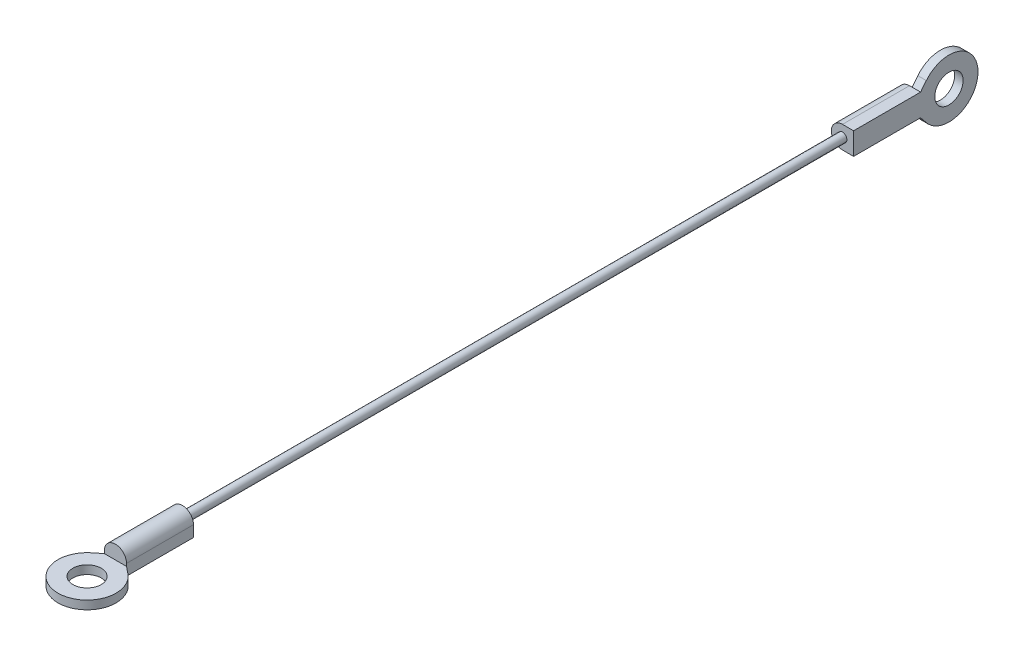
ISO-10303-21;
HEADER;
FILE_DESCRIPTION(('STEP AP214'),'2;1');
FILE_NAME('part.step','',(''),(''),'','','');
FILE_SCHEMA(('AUTOMOTIVE_DESIGN { 1 0 10303 214 1 1 1 1 }'));
ENDSEC;
DATA;
#1=APPLICATION_CONTEXT('core data for automotive mechanical design processes');
#2=APPLICATION_PROTOCOL_DEFINITION('international standard','automotive_design',2000,#1);
#3=PRODUCT_CONTEXT('',#1,'mechanical');
#4=PRODUCT('Part','Part','',(#3));
#5=PRODUCT_RELATED_PRODUCT_CATEGORY('part','',(#4));
#6=PRODUCT_DEFINITION_FORMATION('','',#4);
#7=PRODUCT_DEFINITION_CONTEXT('part definition',#1,'design');
#8=PRODUCT_DEFINITION('design','',#6,#7);
#9=PRODUCT_DEFINITION_SHAPE('','',#8);
#10=(LENGTH_UNIT() NAMED_UNIT(*) SI_UNIT(.MILLI.,.METRE.));
#11=(NAMED_UNIT(*) PLANE_ANGLE_UNIT() SI_UNIT($,.RADIAN.));
#12=(NAMED_UNIT(*) SI_UNIT($,.STERADIAN.) SOLID_ANGLE_UNIT());
#13=UNCERTAINTY_MEASURE_WITH_UNIT(LENGTH_MEASURE(1.E-05),#10,'distance_accuracy_value','');
#14=(GEOMETRIC_REPRESENTATION_CONTEXT(3) GLOBAL_UNCERTAINTY_ASSIGNED_CONTEXT((#13)) GLOBAL_UNIT_ASSIGNED_CONTEXT((#10,
#11,#12)) REPRESENTATION_CONTEXT('',''));
#15=CARTESIAN_POINT('',(0.,0.,0.));
#16=DIRECTION('',(0.,0.,1.));
#17=DIRECTION('',(1.,0.,0.));
#18=AXIS2_PLACEMENT_3D('',#15,#16,#17);
#19=CARTESIAN_POINT('',(0.,0.,-71.12));
#20=DIRECTION('',(0.,0.,-1.));
#21=DIRECTION('',(-1.,0.,0.));
#22=AXIS2_PLACEMENT_3D('',#19,#20,#21);
#23=PLANE('',#22);
#24=DIRECTION('',(1.,0.,0.));
#25=VECTOR('',#24,1.);
#26=CARTESIAN_POINT('',(0.,1.99,-71.12));
#27=LINE('',#26,#25);
#28=CARTESIAN_POINT('',(0.,1.99,-71.12));
#29=VERTEX_POINT('',#28);
#30=CARTESIAN_POINT('',(0.47,1.99,-71.12));
#31=VERTEX_POINT('',#30);
#32=EDGE_CURVE('E197',#29,#31,#27,.T.);
#33=ORIENTED_EDGE('',*,*,#32,.T.);
#34=DIRECTION('',(0.,-1.,0.));
#35=VECTOR('',#34,1.);
#36=CARTESIAN_POINT('',(0.47,-1.99,-71.12));
#37=LINE('',#36,#35);
#38=CARTESIAN_POINT('',(0.47,-1.99,-71.12));
#39=VERTEX_POINT('',#38);
#40=EDGE_CURVE('E154',#31,#39,#37,.T.);
#41=ORIENTED_EDGE('',*,*,#40,.T.);
#42=DIRECTION('',(-1.,0.,0.));
#43=VECTOR('',#42,1.);
#44=CARTESIAN_POINT('',(1.99,-1.99,-71.12));
#45=LINE('',#44,#43);
#46=CARTESIAN_POINT('',(0.,-1.99,-71.12));
#47=VERTEX_POINT('',#46);
#48=EDGE_CURVE('E202',#39,#47,#45,.T.);
#49=ORIENTED_EDGE('',*,*,#48,.T.);
#50=CARTESIAN_POINT('',(0.,0.,-71.12));
#51=DIRECTION('',(0.,0.,-1.));
#52=DIRECTION('',(-1.,0.,0.));
#53=AXIS2_PLACEMENT_3D('',#50,#51,#52);
#54=CIRCLE('',#53,1.99);
#55=EDGE_CURVE('E193',#47,#29,#54,.T.);
#56=ORIENTED_EDGE('',*,*,#55,.T.);
#57=EDGE_LOOP('',(#33,#41,#49,#56));
#58=FACE_BOUND('',#57,.T.);
#59=ADVANCED_FACE('F39',(#58),#23,.T.);
#60=CARTESIAN_POINT('',(0.,0.,71.12));
#61=DIRECTION('',(0.,0.,1.));
#62=DIRECTION('',(1.,0.,0.));
#63=AXIS2_PLACEMENT_3D('',#60,#61,#62);
#64=PLANE('',#63);
#65=DIRECTION('',(0.,-1.,0.));
#66=VECTOR('',#65,1.);
#67=CARTESIAN_POINT('',(-1.99,0.,71.12));
#68=LINE('',#67,#66);
#69=CARTESIAN_POINT('',(-1.99,0.,71.12));
#70=VERTEX_POINT('',#69);
#71=CARTESIAN_POINT('',(-1.99,-0.47,71.12));
#72=VERTEX_POINT('',#71);
#73=EDGE_CURVE('E280',#70,#72,#68,.T.);
#74=ORIENTED_EDGE('',*,*,#73,.T.);
#75=DIRECTION('',(1.,0.,0.));
#76=VECTOR('',#75,1.);
#77=CARTESIAN_POINT('',(-1.99,-0.47,71.12));
#78=LINE('',#77,#76);
#79=CARTESIAN_POINT('',(1.99,-0.47,71.12));
#80=VERTEX_POINT('',#79);
#81=EDGE_CURVE('E241',#72,#80,#78,.T.);
#82=ORIENTED_EDGE('',*,*,#81,.T.);
#83=DIRECTION('',(0.,1.,0.));
#84=VECTOR('',#83,1.);
#85=CARTESIAN_POINT('',(1.99,-1.99,71.12));
#86=LINE('',#85,#84);
#87=CARTESIAN_POINT('',(1.99,0.,71.12));
#88=VERTEX_POINT('',#87);
#89=EDGE_CURVE('E285',#80,#88,#86,.T.);
#90=ORIENTED_EDGE('',*,*,#89,.T.);
#91=CARTESIAN_POINT('',(0.,0.,71.12));
#92=DIRECTION('',(0.,0.,1.));
#93=DIRECTION('',(1.,0.,0.));
#94=AXIS2_PLACEMENT_3D('',#91,#92,#93);
#95=CIRCLE('',#94,1.99);
#96=EDGE_CURVE('E276',#88,#70,#95,.T.);
#97=ORIENTED_EDGE('',*,*,#96,.T.);
#98=EDGE_LOOP('',(#74,#82,#90,#97));
#99=FACE_BOUND('',#98,.T.);
#100=ADVANCED_FACE('F338',(#99),#64,.T.);
#101=CARTESIAN_POINT('',(0.,0.,59.12));
#102=DIRECTION('',(0.,0.,-1.));
#103=DIRECTION('',(-1.,0.,0.));
#104=AXIS2_PLACEMENT_3D('',#101,#102,#103);
#105=CYLINDRICAL_SURFACE('',#104,0.795);
#106=CARTESIAN_POINT('',(0.,0.,59.12));
#107=DIRECTION('',(0.,0.,1.));
#108=DIRECTION('',(1.,0.,0.));
#109=AXIS2_PLACEMENT_3D('',#106,#107,#108);
#110=CIRCLE('',#109,0.795);
#111=CARTESIAN_POINT('',(0.795,0.,59.12));
#112=VERTEX_POINT('',#111);
#113=EDGE_CURVE('E11',#112,#112,#110,.T.);
#114=ORIENTED_EDGE('',*,*,#113,.F.);
#115=EDGE_LOOP('',(#114));
#116=FACE_BOUND('',#115,.T.);
#117=CARTESIAN_POINT('',(0.,0.,-59.12));
#118=DIRECTION('',(0.,0.,1.));
#119=DIRECTION('',(1.,0.,0.));
#120=AXIS2_PLACEMENT_3D('',#117,#118,#119);
#121=CIRCLE('',#120,0.795);
#122=CARTESIAN_POINT('',(0.795,0.,-59.12));
#123=VERTEX_POINT('',#122);
#124=EDGE_CURVE('E43',#123,#123,#121,.T.);
#125=ORIENTED_EDGE('',*,*,#124,.T.);
#126=EDGE_LOOP('',(#125));
#127=FACE_BOUND('',#126,.T.);
#128=ADVANCED_FACE('F41',(#116,#127),#105,.T.);
#129=CARTESIAN_POINT('',(0.,0.,71.12));
#130=DIRECTION('',(0.,0.,-1.));
#131=DIRECTION('',(-1.,0.,0.));
#132=AXIS2_PLACEMENT_3D('',#129,#130,#131);
#133=CYLINDRICAL_SURFACE('',#132,1.99);
#134=CARTESIAN_POINT('',(0.,0.,59.12));
#135=DIRECTION('',(0.,0.,1.));
#136=DIRECTION('',(1.,0.,0.));
#137=AXIS2_PLACEMENT_3D('',#134,#135,#136);
#138=CIRCLE('',#137,1.99);
#139=CARTESIAN_POINT('',(1.99,0.,59.12));
#140=VERTEX_POINT('',#139);
#141=CARTESIAN_POINT('',(-1.99,0.,59.12));
#142=VERTEX_POINT('',#141);
#143=EDGE_CURVE('E270',#140,#142,#138,.T.);
#144=ORIENTED_EDGE('',*,*,#143,.T.);
#145=DIRECTION('',(0.,0.,-1.));
#146=VECTOR('',#145,1.);
#147=CARTESIAN_POINT('',(-1.99,0.,71.12));
#148=LINE('',#147,#146);
#149=EDGE_CURVE('E49',#70,#142,#148,.T.);
#150=ORIENTED_EDGE('',*,*,#149,.F.);
#151=ORIENTED_EDGE('',*,*,#96,.F.);
#152=DIRECTION('',(0.,0.,-1.));
#153=VECTOR('',#152,1.);
#154=CARTESIAN_POINT('',(1.99,0.,71.12));
#155=LINE('',#154,#153);
#156=EDGE_CURVE('E289',#88,#140,#155,.T.);
#157=ORIENTED_EDGE('',*,*,#156,.T.);
#158=EDGE_LOOP('',(#144,#150,#151,#157));
#159=FACE_BOUND('',#158,.T.);
#160=ADVANCED_FACE('F322',(#159),#133,.T.);
#161=CARTESIAN_POINT('',(-1.99,0.,71.12));
#162=DIRECTION('',(1.,0.,0.));
#163=DIRECTION('',(0.,1.,0.));
#164=AXIS2_PLACEMENT_3D('',#161,#162,#163);
#165=PLANE('',#164);
#166=DIRECTION('',(0.,-1.,0.));
#167=VECTOR('',#166,1.);
#168=CARTESIAN_POINT('',(-1.99,0.,59.12));
#169=LINE('',#168,#167);
#170=CARTESIAN_POINT('',(-1.99,-1.99,59.12));
#171=VERTEX_POINT('',#170);
#172=EDGE_CURVE('E293',#142,#171,#169,.T.);
#173=ORIENTED_EDGE('',*,*,#172,.T.);
#174=DIRECTION('',(0.,0.,-1.));
#175=VECTOR('',#174,1.);
#176=CARTESIAN_POINT('',(-1.99,-1.99,71.12));
#177=LINE('',#176,#175);
#178=CARTESIAN_POINT('',(-1.99,-1.99,71.12));
#179=VERTEX_POINT('',#178);
#180=EDGE_CURVE('E309',#179,#171,#177,.T.);
#181=ORIENTED_EDGE('',*,*,#180,.F.);
#182=DIRECTION('',(0.,-1.,0.));
#183=VECTOR('',#182,1.);
#184=CARTESIAN_POINT('',(-1.99,-0.47,71.12));
#185=LINE('',#184,#183);
#186=EDGE_CURVE('E267',#72,#179,#185,.T.);
#187=ORIENTED_EDGE('',*,*,#186,.F.);
#188=ORIENTED_EDGE('',*,*,#73,.F.);
#189=ORIENTED_EDGE('',*,*,#149,.T.);
#190=EDGE_LOOP('',(#173,#181,#187,#188,#189));
#191=FACE_BOUND('',#190,.T.);
#192=ADVANCED_FACE('F316',(#191),#165,.F.);
#193=CARTESIAN_POINT('',(0.,-1.99,71.12));
#194=DIRECTION('',(0.,1.,0.));
#195=DIRECTION('',(0.,0.,1.));
#196=AXIS2_PLACEMENT_3D('',#193,#194,#195);
#197=PLANE('',#196);
#198=DIRECTION('',(1.,0.,0.));
#199=VECTOR('',#198,1.);
#200=CARTESIAN_POINT('',(0.,-1.99,59.12));
#201=LINE('',#200,#199);
#202=CARTESIAN_POINT('',(1.99,-1.99,59.12));
#203=VERTEX_POINT('',#202);
#204=EDGE_CURVE('E297',#171,#203,#201,.T.);
#205=ORIENTED_EDGE('',*,*,#204,.T.);
#206=DIRECTION('',(0.,0.,-1.));
#207=VECTOR('',#206,1.);
#208=CARTESIAN_POINT('',(1.99,-1.99,71.12));
#209=LINE('',#208,#207);
#210=CARTESIAN_POINT('',(1.99,-1.99,71.12));
#211=VERTEX_POINT('',#210);
#212=EDGE_CURVE('E305',#211,#203,#209,.T.);
#213=ORIENTED_EDGE('',*,*,#212,.F.);
#214=DIRECTION('',(0.778962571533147,0.,0.627070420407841));
#215=VECTOR('',#214,1.);
#216=CARTESIAN_POINT('',(1.99,-1.99,71.12));
#217=LINE('',#216,#215);
#218=CARTESIAN_POINT('',(3.26390153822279,-1.99,72.14549981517));
#219=VERTEX_POINT('',#218);
#220=EDGE_CURVE('E237',#211,#219,#217,.T.);
#221=ORIENTED_EDGE('',*,*,#220,.T.);
#222=CARTESIAN_POINT('',(0.,-1.99,76.2));
#223=DIRECTION('',(0.,-1.,0.));
#224=DIRECTION('',(0.,0.,-1.));
#225=AXIS2_PLACEMENT_3D('',#222,#223,#224);
#226=CIRCLE('',#225,5.20499999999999);
#227=CARTESIAN_POINT('',(-3.26390153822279,-1.99,72.14549981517));
#228=VERTEX_POINT('',#227);
#229=EDGE_CURVE('E260',#219,#228,#226,.T.);
#230=ORIENTED_EDGE('',*,*,#229,.T.);
#231=DIRECTION('',(0.778962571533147,0.,-0.627070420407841));
#232=VECTOR('',#231,1.);
#233=CARTESIAN_POINT('',(-3.26390153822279,-1.99,72.14549981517));
#234=LINE('',#233,#232);
#235=EDGE_CURVE('E245',#228,#179,#234,.T.);
#236=ORIENTED_EDGE('',*,*,#235,.T.);
#237=ORIENTED_EDGE('',*,*,#180,.T.);
#238=EDGE_LOOP('',(#205,#213,#221,#230,#236,#237));
#239=FACE_BOUND('',#238,.T.);
#240=CARTESIAN_POINT('',(0.,-1.99,76.2));
#241=DIRECTION('',(0.,-1.,0.));
#242=DIRECTION('',(0.,0.,-1.));
#243=AXIS2_PLACEMENT_3D('',#240,#241,#242);
#244=CIRCLE('',#243,2.54);
#245=CARTESIAN_POINT('',(0.,-1.99,73.66));
#246=VERTEX_POINT('',#245);
#247=EDGE_CURVE('E238',#246,#246,#244,.T.);
#248=ORIENTED_EDGE('',*,*,#247,.F.);
#249=EDGE_LOOP('',(#248));
#250=FACE_BOUND('',#249,.T.);
#251=ADVANCED_FACE('F329',(#239,#250),#197,.F.);
#252=CARTESIAN_POINT('',(1.99,-1.99,71.12));
#253=DIRECTION('',(-1.,0.,0.));
#254=DIRECTION('',(0.,-1.,0.));
#255=AXIS2_PLACEMENT_3D('',#252,#253,#254);
#256=PLANE('',#255);
#257=DIRECTION('',(0.,1.,0.));
#258=VECTOR('',#257,1.);
#259=CARTESIAN_POINT('',(1.99,-1.99,59.12));
#260=LINE('',#259,#258);
#261=EDGE_CURVE('E281',#203,#140,#260,.T.);
#262=ORIENTED_EDGE('',*,*,#261,.T.);
#263=ORIENTED_EDGE('',*,*,#156,.F.);
#264=ORIENTED_EDGE('',*,*,#89,.F.);
#265=EDGE_CURVE('E286',#211,#80,#86,.T.);
#266=ORIENTED_EDGE('',*,*,#265,.F.);
#267=ORIENTED_EDGE('',*,*,#212,.T.);
#268=EDGE_LOOP('',(#262,#263,#264,#266,#267));
#269=FACE_BOUND('',#268,.T.);
#270=ADVANCED_FACE('F333',(#269),#256,.F.);
#271=CARTESIAN_POINT('',(0.,0.,59.12));
#272=DIRECTION('',(0.,0.,1.));
#273=DIRECTION('',(1.,0.,0.));
#274=AXIS2_PLACEMENT_3D('',#271,#272,#273);
#275=PLANE('',#274);
#276=ORIENTED_EDGE('',*,*,#113,.T.);
#277=EDGE_LOOP('',(#276));
#278=FACE_BOUND('',#277,.T.);
#279=ORIENTED_EDGE('',*,*,#143,.F.);
#280=ORIENTED_EDGE('',*,*,#261,.F.);
#281=ORIENTED_EDGE('',*,*,#204,.F.);
#282=ORIENTED_EDGE('',*,*,#172,.F.);
#283=EDGE_LOOP('',(#279,#280,#281,#282));
#284=FACE_BOUND('',#283,.T.);
#285=ADVANCED_FACE('F326',(#278,#284),#275,.F.);
#286=CARTESIAN_POINT('',(-3.26390153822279,-0.47,72.14549981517));
#287=DIRECTION('',(-0.627070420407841,0.,-0.778962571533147));
#288=DIRECTION('',(-0.778962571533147,0.,0.627070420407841));
#289=AXIS2_PLACEMENT_3D('',#286,#287,#288);
#290=PLANE('',#289);
#291=ORIENTED_EDGE('',*,*,#235,.F.);
#292=DIRECTION('',(0.,-1.,0.));
#293=VECTOR('',#292,1.);
#294=CARTESIAN_POINT('',(-3.26390153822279,-0.47,72.14549981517));
#295=LINE('',#294,#293);
#296=CARTESIAN_POINT('',(-3.26390153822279,-0.47,72.14549981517));
#297=VERTEX_POINT('',#296);
#298=EDGE_CURVE('E271',#297,#228,#295,.T.);
#299=ORIENTED_EDGE('',*,*,#298,.F.);
#300=DIRECTION('',(0.778962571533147,0.,-0.627070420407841));
#301=VECTOR('',#300,1.);
#302=CARTESIAN_POINT('',(-3.26390153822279,-0.47,72.14549981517));
#303=LINE('',#302,#301);
#304=EDGE_CURVE('E252',#297,#72,#303,.T.);
#305=ORIENTED_EDGE('',*,*,#304,.T.);
#306=ORIENTED_EDGE('',*,*,#186,.T.);
#307=EDGE_LOOP('',(#291,#299,#305,#306));
#308=FACE_BOUND('',#307,.T.);
#309=ADVANCED_FACE('F343',(#308),#290,.T.);
#310=CARTESIAN_POINT('',(0.,-0.47,76.2));
#311=DIRECTION('',(0.,-1.,0.));
#312=DIRECTION('',(0.,0.,-1.));
#313=AXIS2_PLACEMENT_3D('',#310,#311,#312);
#314=CYLINDRICAL_SURFACE('',#313,5.20499999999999);
#315=ORIENTED_EDGE('',*,*,#229,.F.);
#316=DIRECTION('',(0.,-1.,0.));
#317=VECTOR('',#316,1.);
#318=CARTESIAN_POINT('',(3.26390153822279,-0.47,72.14549981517));
#319=LINE('',#318,#317);
#320=CARTESIAN_POINT('',(3.26390153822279,-0.47,72.14549981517));
#321=VERTEX_POINT('',#320);
#322=EDGE_CURVE('E256',#321,#219,#319,.T.);
#323=ORIENTED_EDGE('',*,*,#322,.F.);
#324=CARTESIAN_POINT('',(0.,-0.47,76.2));
#325=DIRECTION('',(0.,-1.,0.));
#326=DIRECTION('',(0.,0.,-1.));
#327=AXIS2_PLACEMENT_3D('',#324,#325,#326);
#328=CIRCLE('',#327,5.20499999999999);
#329=EDGE_CURVE('E248',#321,#297,#328,.T.);
#330=ORIENTED_EDGE('',*,*,#329,.T.);
#331=ORIENTED_EDGE('',*,*,#298,.T.);
#332=EDGE_LOOP('',(#315,#323,#330,#331));
#333=FACE_BOUND('',#332,.T.);
#334=ADVANCED_FACE('F346',(#333),#314,.T.);
#335=CARTESIAN_POINT('',(1.99,-0.47,71.12));
#336=DIRECTION('',(0.627070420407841,0.,-0.778962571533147));
#337=DIRECTION('',(-0.778962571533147,0.,-0.627070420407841));
#338=AXIS2_PLACEMENT_3D('',#335,#336,#337);
#339=PLANE('',#338);
#340=ORIENTED_EDGE('',*,*,#220,.F.);
#341=ORIENTED_EDGE('',*,*,#265,.T.);
#342=DIRECTION('',(0.778962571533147,0.,0.627070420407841));
#343=VECTOR('',#342,1.);
#344=CARTESIAN_POINT('',(1.99,-0.47,71.12));
#345=LINE('',#344,#343);
#346=EDGE_CURVE('E64',#80,#321,#345,.T.);
#347=ORIENTED_EDGE('',*,*,#346,.T.);
#348=ORIENTED_EDGE('',*,*,#322,.T.);
#349=EDGE_LOOP('',(#340,#341,#347,#348));
#350=FACE_BOUND('',#349,.T.);
#351=ADVANCED_FACE('F336',(#350),#339,.T.);
#352=CARTESIAN_POINT('',(0.,-0.47,76.2));
#353=DIRECTION('',(0.,-1.,0.));
#354=DIRECTION('',(0.,0.,-1.));
#355=AXIS2_PLACEMENT_3D('',#352,#353,#354);
#356=PLANE('',#355);
#357=CARTESIAN_POINT('',(0.,-0.47,76.2));
#358=DIRECTION('',(0.,-1.,0.));
#359=DIRECTION('',(0.,0.,-1.));
#360=AXIS2_PLACEMENT_3D('',#357,#358,#359);
#361=CIRCLE('',#360,2.54);
#362=CARTESIAN_POINT('',(0.,-0.47,73.66));
#363=VERTEX_POINT('',#362);
#364=EDGE_CURVE('E233',#363,#363,#361,.T.);
#365=ORIENTED_EDGE('',*,*,#364,.T.);
#366=EDGE_LOOP('',(#365));
#367=FACE_BOUND('',#366,.T.);
#368=ORIENTED_EDGE('',*,*,#81,.F.);
#369=ORIENTED_EDGE('',*,*,#304,.F.);
#370=ORIENTED_EDGE('',*,*,#329,.F.);
#371=ORIENTED_EDGE('',*,*,#346,.F.);
#372=EDGE_LOOP('',(#368,#369,#370,#371));
#373=FACE_BOUND('',#372,.T.);
#374=ADVANCED_FACE('F340',(#367,#373),#356,.F.);
#375=CARTESIAN_POINT('',(0.,-0.47,76.2));
#376=DIRECTION('',(0.,-1.,0.));
#377=DIRECTION('',(0.,0.,-1.));
#378=AXIS2_PLACEMENT_3D('',#375,#376,#377);
#379=CYLINDRICAL_SURFACE('',#378,2.54);
#380=ORIENTED_EDGE('',*,*,#364,.F.);
#381=EDGE_LOOP('',(#380));
#382=FACE_BOUND('',#381,.T.);
#383=ORIENTED_EDGE('',*,*,#247,.T.);
#384=EDGE_LOOP('',(#383));
#385=FACE_BOUND('',#384,.T.);
#386=ADVANCED_FACE('F384',(#382,#385),#379,.F.);
#387=CARTESIAN_POINT('',(0.,0.,-71.12));
#388=DIRECTION('',(0.,0.,1.));
#389=DIRECTION('',(1.,0.,0.));
#390=AXIS2_PLACEMENT_3D('',#387,#388,#389);
#391=CYLINDRICAL_SURFACE('',#390,1.99);
#392=CARTESIAN_POINT('',(0.,0.,-59.12));
#393=DIRECTION('',(0.,0.,-1.));
#394=DIRECTION('',(-1.,0.,0.));
#395=AXIS2_PLACEMENT_3D('',#392,#393,#394);
#396=CIRCLE('',#395,1.99);
#397=CARTESIAN_POINT('',(0.,-1.99,-59.12));
#398=VERTEX_POINT('',#397);
#399=CARTESIAN_POINT('',(0.,1.99,-59.12));
#400=VERTEX_POINT('',#399);
#401=EDGE_CURVE('E190',#398,#400,#396,.T.);
#402=ORIENTED_EDGE('',*,*,#401,.T.);
#403=DIRECTION('',(0.,0.,1.));
#404=VECTOR('',#403,1.);
#405=CARTESIAN_POINT('',(0.,1.99,-71.12));
#406=LINE('',#405,#404);
#407=EDGE_CURVE('E229',#29,#400,#406,.T.);
#408=ORIENTED_EDGE('',*,*,#407,.F.);
#409=ORIENTED_EDGE('',*,*,#55,.F.);
#410=DIRECTION('',(0.,0.,1.));
#411=VECTOR('',#410,1.);
#412=CARTESIAN_POINT('',(0.,-1.99,-71.12));
#413=LINE('',#412,#411);
#414=EDGE_CURVE('E205',#47,#398,#413,.T.);
#415=ORIENTED_EDGE('',*,*,#414,.T.);
#416=EDGE_LOOP('',(#402,#408,#409,#415));
#417=FACE_BOUND('',#416,.T.);
#418=ADVANCED_FACE('F380',(#417),#391,.T.);
#419=CARTESIAN_POINT('',(0.,1.99,-71.12));
#420=DIRECTION('',(0.,-1.,0.));
#421=DIRECTION('',(0.,0.,-1.));
#422=AXIS2_PLACEMENT_3D('',#419,#420,#421);
#423=PLANE('',#422);
#424=DIRECTION('',(1.,0.,0.));
#425=VECTOR('',#424,1.);
#426=CARTESIAN_POINT('',(0.,1.99,-59.12));
#427=LINE('',#426,#425);
#428=CARTESIAN_POINT('',(1.99,1.99,-59.12));
#429=VERTEX_POINT('',#428);
#430=EDGE_CURVE('E209',#400,#429,#427,.T.);
#431=ORIENTED_EDGE('',*,*,#430,.T.);
#432=DIRECTION('',(0.,0.,1.));
#433=VECTOR('',#432,1.);
#434=CARTESIAN_POINT('',(1.99,1.99,-71.12));
#435=LINE('',#434,#433);
#436=CARTESIAN_POINT('',(1.99,1.99,-71.12));
#437=VERTEX_POINT('',#436);
#438=EDGE_CURVE('E225',#437,#429,#435,.T.);
#439=ORIENTED_EDGE('',*,*,#438,.F.);
#440=DIRECTION('',(1.,0.,0.));
#441=VECTOR('',#440,1.);
#442=CARTESIAN_POINT('',(0.47,1.99,-71.12));
#443=LINE('',#442,#441);
#444=EDGE_CURVE('E187',#31,#437,#443,.T.);
#445=ORIENTED_EDGE('',*,*,#444,.F.);
#446=ORIENTED_EDGE('',*,*,#32,.F.);
#447=ORIENTED_EDGE('',*,*,#407,.T.);
#448=EDGE_LOOP('',(#431,#439,#445,#446,#447));
#449=FACE_BOUND('',#448,.T.);
#450=ADVANCED_FACE('F376',(#449),#423,.F.);
#451=CARTESIAN_POINT('',(1.99,0.,-71.12));
#452=DIRECTION('',(-1.,0.,0.));
#453=DIRECTION('',(0.,-1.,0.));
#454=AXIS2_PLACEMENT_3D('',#451,#452,#453);
#455=PLANE('',#454);
#456=DIRECTION('',(0.,-1.,0.));
#457=VECTOR('',#456,1.);
#458=CARTESIAN_POINT('',(1.99,0.,-59.12));
#459=LINE('',#458,#457);
#460=CARTESIAN_POINT('',(1.99,-1.99,-59.12));
#461=VERTEX_POINT('',#460);
#462=EDGE_CURVE('E213',#429,#461,#459,.T.);
#463=ORIENTED_EDGE('',*,*,#462,.T.);
#464=DIRECTION('',(0.,0.,1.));
#465=VECTOR('',#464,1.);
#466=CARTESIAN_POINT('',(1.99,-1.99,-71.12));
#467=LINE('',#466,#465);
#468=CARTESIAN_POINT('',(1.99,-1.99,-71.12));
#469=VERTEX_POINT('',#468);
#470=EDGE_CURVE('E221',#469,#461,#467,.T.);
#471=ORIENTED_EDGE('',*,*,#470,.F.);
#472=DIRECTION('',(0.,-0.778962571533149,-0.627070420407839));
#473=VECTOR('',#472,1.);
#474=CARTESIAN_POINT('',(1.99,-3.26390153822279,-72.14549981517));
#475=LINE('',#474,#473);
#476=CARTESIAN_POINT('',(1.99,-3.2639015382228,-72.14549981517));
#477=VERTEX_POINT('',#476);
#478=EDGE_CURVE('E181',#469,#477,#475,.T.);
#479=ORIENTED_EDGE('',*,*,#478,.T.);
#480=CARTESIAN_POINT('',(1.99,0.,-76.2));
#481=DIRECTION('',(1.,0.,0.));
#482=DIRECTION('',(0.,0.,1.));
#483=AXIS2_PLACEMENT_3D('',#480,#481,#482);
#484=CIRCLE('',#483,5.205);
#485=CARTESIAN_POINT('',(1.99,3.26390153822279,-72.14549981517));
#486=VERTEX_POINT('',#485);
#487=EDGE_CURVE('E149',#477,#486,#484,.T.);
#488=ORIENTED_EDGE('',*,*,#487,.T.);
#489=DIRECTION('',(0.,-0.778962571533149,0.627070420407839));
#490=VECTOR('',#489,1.);
#491=CARTESIAN_POINT('',(1.99,1.99,-71.12));
#492=LINE('',#491,#490);
#493=EDGE_CURVE('E166',#486,#437,#492,.T.);
#494=ORIENTED_EDGE('',*,*,#493,.T.);
#495=ORIENTED_EDGE('',*,*,#438,.T.);
#496=EDGE_LOOP('',(#463,#471,#479,#488,#494,#495));
#497=FACE_BOUND('',#496,.T.);
#498=CARTESIAN_POINT('',(1.99,0.,-76.2));
#499=DIRECTION('',(1.,0.,0.));
#500=DIRECTION('',(0.,0.,-1.));
#501=AXIS2_PLACEMENT_3D('',#498,#499,#500);
#502=CIRCLE('',#501,2.54);
#503=CARTESIAN_POINT('',(1.99,0.,-78.74));
#504=VERTEX_POINT('',#503);
#505=EDGE_CURVE('E174',#504,#504,#502,.T.);
#506=ORIENTED_EDGE('',*,*,#505,.F.);
#507=EDGE_LOOP('',(#506));
#508=FACE_BOUND('',#507,.T.);
#509=ADVANCED_FACE('F372',(#497,#508),#455,.F.);
#510=CARTESIAN_POINT('',(1.99,-1.99,-71.12));
#511=DIRECTION('',(0.,1.,0.));
#512=DIRECTION('',(0.,0.,1.));
#513=AXIS2_PLACEMENT_3D('',#510,#511,#512);
#514=PLANE('',#513);
#515=DIRECTION('',(-1.,0.,0.));
#516=VECTOR('',#515,1.);
#517=CARTESIAN_POINT('',(1.99,-1.99,-59.12));
#518=LINE('',#517,#516);
#519=EDGE_CURVE('E198',#461,#398,#518,.T.);
#520=ORIENTED_EDGE('',*,*,#519,.T.);
#521=ORIENTED_EDGE('',*,*,#414,.F.);
#522=ORIENTED_EDGE('',*,*,#48,.F.);
#523=EDGE_CURVE('E163',#469,#39,#45,.T.);
#524=ORIENTED_EDGE('',*,*,#523,.F.);
#525=ORIENTED_EDGE('',*,*,#470,.T.);
#526=EDGE_LOOP('',(#520,#521,#522,#524,#525));
#527=FACE_BOUND('',#526,.T.);
#528=ADVANCED_FACE('F368',(#527),#514,.F.);
#529=CARTESIAN_POINT('',(0.,0.,-59.12));
#530=DIRECTION('',(0.,0.,-1.));
#531=DIRECTION('',(-1.,0.,0.));
#532=AXIS2_PLACEMENT_3D('',#529,#530,#531);
#533=PLANE('',#532);
#534=ORIENTED_EDGE('',*,*,#124,.F.);
#535=EDGE_LOOP('',(#534));
#536=FACE_BOUND('',#535,.T.);
#537=ORIENTED_EDGE('',*,*,#401,.F.);
#538=ORIENTED_EDGE('',*,*,#519,.F.);
#539=ORIENTED_EDGE('',*,*,#462,.F.);
#540=ORIENTED_EDGE('',*,*,#430,.F.);
#541=EDGE_LOOP('',(#537,#538,#539,#540));
#542=FACE_BOUND('',#541,.T.);
#543=ADVANCED_FACE('F365',(#536,#542),#533,.F.);
#544=CARTESIAN_POINT('',(0.47,-3.26390153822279,-72.14549981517));
#545=DIRECTION('',(0.,-0.627070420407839,0.778962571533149));
#546=DIRECTION('',(0.,-0.778962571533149,-0.627070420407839));
#547=AXIS2_PLACEMENT_3D('',#544,#545,#546);
#548=PLANE('',#547);
#549=ORIENTED_EDGE('',*,*,#478,.F.);
#550=ORIENTED_EDGE('',*,*,#523,.T.);
#551=DIRECTION('',(0.,-0.778962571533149,-0.627070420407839));
#552=VECTOR('',#551,1.);
#553=CARTESIAN_POINT('',(0.47,-3.26390153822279,-72.14549981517));
#554=LINE('',#553,#552);
#555=CARTESIAN_POINT('',(0.47,-3.2639015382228,-72.14549981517));
#556=VERTEX_POINT('',#555);
#557=EDGE_CURVE('E56',#39,#556,#554,.T.);
#558=ORIENTED_EDGE('',*,*,#557,.T.);
#559=DIRECTION('',(1.,0.,0.));
#560=VECTOR('',#559,1.);
#561=CARTESIAN_POINT('',(0.47,-3.2639015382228,-72.14549981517));
#562=LINE('',#561,#560);
#563=EDGE_CURVE('E145',#556,#477,#562,.T.);
#564=ORIENTED_EDGE('',*,*,#563,.T.);
#565=EDGE_LOOP('',(#549,#550,#558,#564));
#566=FACE_BOUND('',#565,.T.);
#567=ADVANCED_FACE('F161',(#566),#548,.T.);
#568=CARTESIAN_POINT('',(0.47,1.99,-71.12));
#569=DIRECTION('',(0.,0.627070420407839,0.778962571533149));
#570=DIRECTION('',(0.,-0.778962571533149,0.627070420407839));
#571=AXIS2_PLACEMENT_3D('',#568,#569,#570);
#572=PLANE('',#571);
#573=ORIENTED_EDGE('',*,*,#493,.F.);
#574=DIRECTION('',(1.,0.,0.));
#575=VECTOR('',#574,1.);
#576=CARTESIAN_POINT('',(0.47,3.26390153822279,-72.14549981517));
#577=LINE('',#576,#575);
#578=CARTESIAN_POINT('',(0.47,3.26390153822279,-72.14549981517));
#579=VERTEX_POINT('',#578);
#580=EDGE_CURVE('E153',#579,#486,#577,.T.);
#581=ORIENTED_EDGE('',*,*,#580,.F.);
#582=DIRECTION('',(0.,-0.778962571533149,0.627070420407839));
#583=VECTOR('',#582,1.);
#584=CARTESIAN_POINT('',(0.47,1.99,-71.12));
#585=LINE('',#584,#583);
#586=EDGE_CURVE('E158',#579,#31,#585,.T.);
#587=ORIENTED_EDGE('',*,*,#586,.T.);
#588=ORIENTED_EDGE('',*,*,#444,.T.);
#589=EDGE_LOOP('',(#573,#581,#587,#588));
#590=FACE_BOUND('',#589,.T.);
#591=ADVANCED_FACE('F428',(#590),#572,.T.);
#592=CARTESIAN_POINT('',(0.47,0.,-76.2));
#593=DIRECTION('',(1.,0.,0.));
#594=DIRECTION('',(0.,0.,-1.));
#595=AXIS2_PLACEMENT_3D('',#592,#593,#594);
#596=CYLINDRICAL_SURFACE('',#595,5.205);
#597=ORIENTED_EDGE('',*,*,#487,.F.);
#598=ORIENTED_EDGE('',*,*,#563,.F.);
#599=CARTESIAN_POINT('',(0.47,0.,-76.2));
#600=DIRECTION('',(1.,0.,0.));
#601=DIRECTION('',(0.,0.,1.));
#602=AXIS2_PLACEMENT_3D('',#599,#600,#601);
#603=CIRCLE('',#602,5.205);
#604=EDGE_CURVE('E147',#556,#579,#603,.T.);
#605=ORIENTED_EDGE('',*,*,#604,.T.);
#606=ORIENTED_EDGE('',*,*,#580,.T.);
#607=EDGE_LOOP('',(#597,#598,#605,#606));
#608=FACE_BOUND('',#607,.T.);
#609=ADVANCED_FACE('F146',(#608),#596,.T.);
#610=CARTESIAN_POINT('',(0.47,0.,-76.2));
#611=DIRECTION('',(-1.,0.,0.));
#612=DIRECTION('',(0.,0.,1.));
#613=AXIS2_PLACEMENT_3D('',#610,#611,#612);
#614=PLANE('',#613);
#615=CARTESIAN_POINT('',(0.47,0.,-76.2));
#616=DIRECTION('',(1.,0.,0.));
#617=DIRECTION('',(0.,0.,-1.));
#618=AXIS2_PLACEMENT_3D('',#615,#616,#617);
#619=CIRCLE('',#618,2.54);
#620=CARTESIAN_POINT('',(0.47,0.,-78.74));
#621=VERTEX_POINT('',#620);
#622=EDGE_CURVE('E184',#621,#621,#619,.T.);
#623=ORIENTED_EDGE('',*,*,#622,.T.);
#624=EDGE_LOOP('',(#623));
#625=FACE_BOUND('',#624,.T.);
#626=ORIENTED_EDGE('',*,*,#557,.F.);
#627=ORIENTED_EDGE('',*,*,#40,.F.);
#628=ORIENTED_EDGE('',*,*,#586,.F.);
#629=ORIENTED_EDGE('',*,*,#604,.F.);
#630=EDGE_LOOP('',(#626,#627,#628,#629));
#631=FACE_BOUND('',#630,.T.);
#632=ADVANCED_FACE('F157',(#625,#631),#614,.T.);
#633=CARTESIAN_POINT('',(0.47,0.,-76.2));
#634=DIRECTION('',(1.,0.,0.));
#635=DIRECTION('',(0.,0.,-1.));
#636=AXIS2_PLACEMENT_3D('',#633,#634,#635);
#637=CYLINDRICAL_SURFACE('',#636,2.54);
#638=ORIENTED_EDGE('',*,*,#622,.F.);
#639=EDGE_LOOP('',(#638));
#640=FACE_BOUND('',#639,.T.);
#641=ORIENTED_EDGE('',*,*,#505,.T.);
#642=EDGE_LOOP('',(#641));
#643=FACE_BOUND('',#642,.T.);
#644=ADVANCED_FACE('F441',(#640,#643),#637,.F.);
#645=CLOSED_SHELL('',(#59,#100,#128,#160,#192,#251,#270,#285,#309,#334,#351,#374,#386,#418,#450,
#509,#528,#543,#567,#591,#609,#632,#644));
#646=MANIFOLD_SOLID_BREP('B2',#645);
#647=ADVANCED_BREP_SHAPE_REPRESENTATION('',(#18,#646),#14);
#648=SHAPE_DEFINITION_REPRESENTATION(#9,#647);
ENDSEC;
END-ISO-10303-21;
